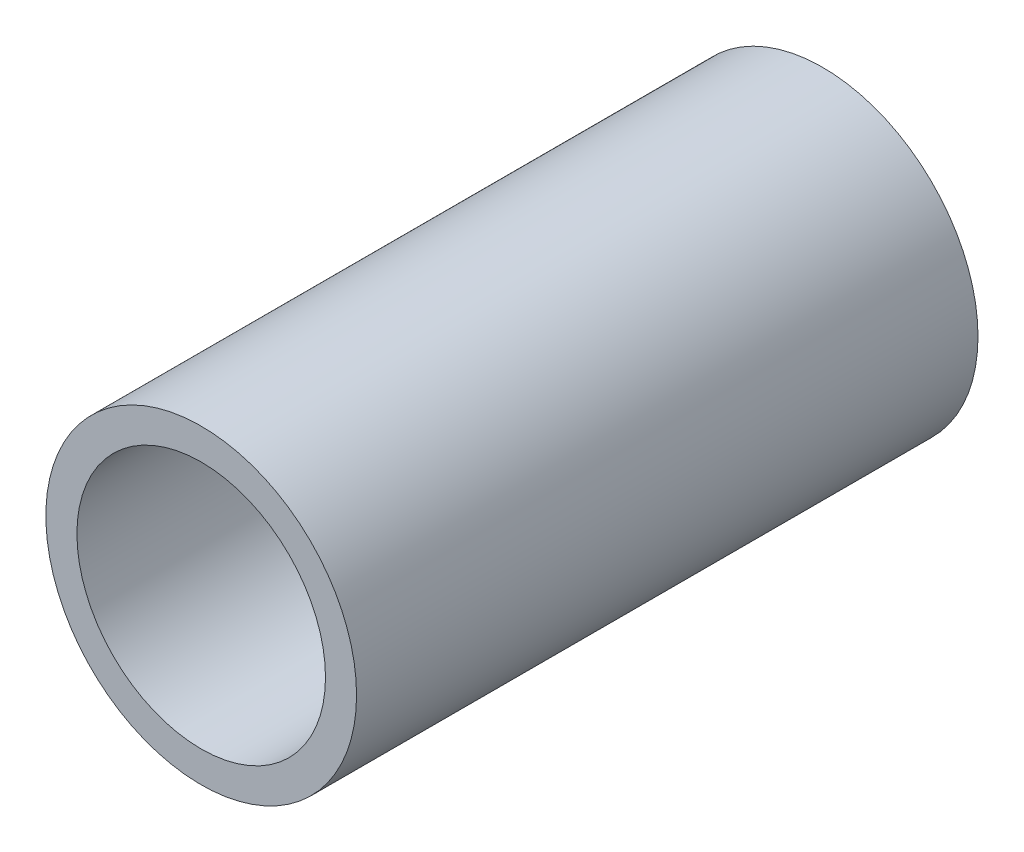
ISO-10303-21;
HEADER;
FILE_DESCRIPTION(('STEP AP214'),'2;1');
FILE_NAME('part.step','',(''),(''),'','','');
FILE_SCHEMA(('AUTOMOTIVE_DESIGN { 1 0 10303 214 1 1 1 1 }'));
ENDSEC;
DATA;
#1=APPLICATION_CONTEXT('core data for automotive mechanical design processes');
#2=APPLICATION_PROTOCOL_DEFINITION('international standard','automotive_design',2000,#1);
#3=PRODUCT_CONTEXT('',#1,'mechanical');
#4=PRODUCT('Part','Part','',(#3));
#5=PRODUCT_RELATED_PRODUCT_CATEGORY('part','',(#4));
#6=PRODUCT_DEFINITION_FORMATION('','',#4);
#7=PRODUCT_DEFINITION_CONTEXT('part definition',#1,'design');
#8=PRODUCT_DEFINITION('design','',#6,#7);
#9=PRODUCT_DEFINITION_SHAPE('','',#8);
#10=(LENGTH_UNIT() NAMED_UNIT(*) SI_UNIT(.MILLI.,.METRE.));
#11=(NAMED_UNIT(*) PLANE_ANGLE_UNIT() SI_UNIT($,.RADIAN.));
#12=(NAMED_UNIT(*) SI_UNIT($,.STERADIAN.) SOLID_ANGLE_UNIT());
#13=UNCERTAINTY_MEASURE_WITH_UNIT(LENGTH_MEASURE(1.E-05),#10,'distance_accuracy_value','');
#14=(GEOMETRIC_REPRESENTATION_CONTEXT(3) GLOBAL_UNCERTAINTY_ASSIGNED_CONTEXT((#13)) GLOBAL_UNIT_ASSIGNED_CONTEXT((#10,
#11,#12)) REPRESENTATION_CONTEXT('',''));
#15=CARTESIAN_POINT('',(0.,0.,0.));
#16=DIRECTION('',(0.,0.,1.));
#17=DIRECTION('',(1.,0.,0.));
#18=AXIS2_PLACEMENT_3D('',#15,#16,#17);
#19=CARTESIAN_POINT('',(0.,0.,20.));
#20=DIRECTION('',(0.,0.,1.));
#21=DIRECTION('',(1.,0.,0.));
#22=AXIS2_PLACEMENT_3D('',#19,#20,#21);
#23=PLANE('',#22);
#24=CARTESIAN_POINT('',(0.,0.,20.));
#25=DIRECTION('',(0.,0.,1.));
#26=DIRECTION('',(1.,0.,0.));
#27=AXIS2_PLACEMENT_3D('',#24,#25,#26);
#28=CIRCLE('',#27,5.);
#29=CARTESIAN_POINT('',(5.,0.,20.));
#30=VERTEX_POINT('',#29);
#31=EDGE_CURVE('E10',#30,#30,#28,.T.);
#32=ORIENTED_EDGE('',*,*,#31,.T.);
#33=EDGE_LOOP('',(#32));
#34=FACE_BOUND('',#33,.T.);
#35=CARTESIAN_POINT('',(0.,0.,20.));
#36=DIRECTION('',(0.,0.,1.));
#37=DIRECTION('',(1.,0.,0.));
#38=AXIS2_PLACEMENT_3D('',#35,#36,#37);
#39=CIRCLE('',#38,4.);
#40=CARTESIAN_POINT('',(4.,0.,20.));
#41=VERTEX_POINT('',#40);
#42=EDGE_CURVE('E37',#41,#41,#39,.T.);
#43=ORIENTED_EDGE('',*,*,#42,.F.);
#44=EDGE_LOOP('',(#43));
#45=FACE_BOUND('',#44,.T.);
#46=ADVANCED_FACE('F26',(#34,#45),#23,.T.);
#47=CARTESIAN_POINT('',(0.,0.,0.));
#48=DIRECTION('',(0.,0.,1.));
#49=DIRECTION('',(1.,0.,0.));
#50=AXIS2_PLACEMENT_3D('',#47,#48,#49);
#51=PLANE('',#50);
#52=CARTESIAN_POINT('',(0.,0.,0.));
#53=DIRECTION('',(0.,0.,1.));
#54=DIRECTION('',(1.,0.,0.));
#55=AXIS2_PLACEMENT_3D('',#52,#53,#54);
#56=CIRCLE('',#55,5.);
#57=CARTESIAN_POINT('',(5.,0.,0.));
#58=VERTEX_POINT('',#57);
#59=EDGE_CURVE('E33',#58,#58,#56,.T.);
#60=ORIENTED_EDGE('',*,*,#59,.F.);
#61=EDGE_LOOP('',(#60));
#62=FACE_BOUND('',#61,.T.);
#63=CARTESIAN_POINT('',(0.,0.,0.));
#64=DIRECTION('',(0.,0.,1.));
#65=DIRECTION('',(1.,0.,0.));
#66=AXIS2_PLACEMENT_3D('',#63,#64,#65);
#67=CIRCLE('',#66,4.);
#68=CARTESIAN_POINT('',(4.,0.,0.));
#69=VERTEX_POINT('',#68);
#70=EDGE_CURVE('E41',#69,#69,#67,.T.);
#71=ORIENTED_EDGE('',*,*,#70,.T.);
#72=EDGE_LOOP('',(#71));
#73=FACE_BOUND('',#72,.T.);
#74=ADVANCED_FACE('F47',(#62,#73),#51,.F.);
#75=CARTESIAN_POINT('',(0.,0.,20.));
#76=DIRECTION('',(0.,0.,-1.));
#77=DIRECTION('',(-1.,0.,0.));
#78=AXIS2_PLACEMENT_3D('',#75,#76,#77);
#79=CYLINDRICAL_SURFACE('',#78,5.);
#80=ORIENTED_EDGE('',*,*,#31,.F.);
#81=EDGE_LOOP('',(#80));
#82=FACE_BOUND('',#81,.T.);
#83=ORIENTED_EDGE('',*,*,#59,.T.);
#84=EDGE_LOOP('',(#83));
#85=FACE_BOUND('',#84,.T.);
#86=ADVANCED_FACE('F28',(#82,#85),#79,.T.);
#87=CARTESIAN_POINT('',(0.,0.,20.));
#88=DIRECTION('',(0.,0.,-1.));
#89=DIRECTION('',(-1.,0.,0.));
#90=AXIS2_PLACEMENT_3D('',#87,#88,#89);
#91=CYLINDRICAL_SURFACE('',#90,4.);
#92=ORIENTED_EDGE('',*,*,#42,.T.);
#93=EDGE_LOOP('',(#92));
#94=FACE_BOUND('',#93,.T.);
#95=ORIENTED_EDGE('',*,*,#70,.F.);
#96=EDGE_LOOP('',(#95));
#97=FACE_BOUND('',#96,.T.);
#98=ADVANCED_FACE('F49',(#94,#97),#91,.F.);
#99=CLOSED_SHELL('',(#46,#74,#86,#98));
#100=MANIFOLD_SOLID_BREP('B2',#99);
#101=ADVANCED_BREP_SHAPE_REPRESENTATION('',(#18,#100),#14);
#102=SHAPE_DEFINITION_REPRESENTATION(#9,#101);
ENDSEC;
END-ISO-10303-21;
